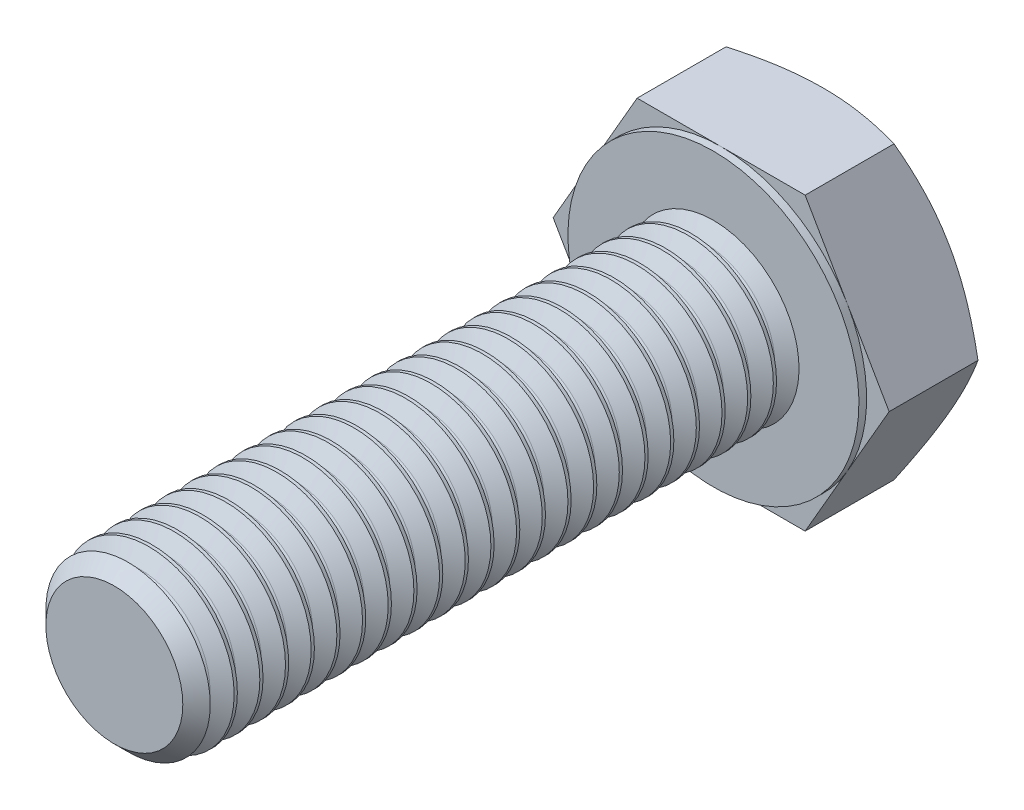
from build123d import *

# Parameters (mm, degrees)
SKETCH5_W               = 35
SKETCH5_H               = 5
THREAD_SIMPLE_COUNT     = 23
THREAD_SIMPLE_PITCH     = 1.5
SKETCH15_W              = 6.4
SKETCH15_H              = 10
SKETCH19_W              = 0.45
SKETCH19_H              = 1.5
SKETCH21_OUTSIDE_W      = 32.028
SKETCH21_OUTSIDE_H      = 32.028
CUT_PROFILE_OUTER_DEPTH = 38.749172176


with BuildPart() as part:
    # Sketch5 → body (revolve)
    with BuildSketch(Plane(origin=(0, 0, 0), x_dir=(0, 0, -1), z_dir=(1, 0, 0)), mode=Mode.PRIVATE) as body_sk:
        with Locations((-17.5, 2.5)):
            Rectangle(SKETCH5_W, SKETCH5_H)
    revolve(body_sk.sketch.rotate(Axis((0, 0, 35), (0, 0, -1)), 180), axis=Axis((0, 0, 35), (0, 0, -1)))

    # Sketch11 → cut-chamfer-start (revolve, cut)
    with BuildSketch(Plane(origin=(0, 0, 0), x_dir=(0, 0, -1), z_dir=(1, 0, 0))):
        Polygon((-35, -5), (-35, -4), (-34, -5), align=None)
    revolve(axis=Axis((0, 0, 35), (0, 0, -1)), mode=Mode.SUBTRACT)

    # Sketch8 → thread-single (revolve, cut)
    with BuildSketch(Plane(origin=(0, 0, 0), x_dir=(0, 0, -1), z_dir=(1, 0, 0)), mode=Mode.PRIVATE) as thread_single_sk:
        with BuildLine():
            Line((-1.3125, -5), (0, -5))
            Line((0, -5), (-0.515625, -4.106911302))
            ThreePointArc((-0.515625, -4.106911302), (-0.65625, -4.025721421), (-0.796875, -4.106911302))
            Line((-0.796875, -4.106911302), (-1.3125, -5))
        make_face()
    thread_single = revolve(thread_single_sk.sketch.rotate(Axis((0, 0, 35), (0, 0, -1)), 270), axis=Axis((0, 0, 35), (0, 0, -1)), mode=Mode.SUBTRACT)

    # thread-simple: thread-single ×23
    with Locations(*[(0, 0, i * THREAD_SIMPLE_PITCH) for i in range(1, THREAD_SIMPLE_COUNT)]):
        add(thread_single, mode=Mode.SUBTRACT)

    # Sketch15 → body-head (revolve)
    with BuildSketch(Plane(origin=(0, 0, 0), x_dir=(0, 0, -1), z_dir=(1, 0, 0)), mode=Mode.PRIVATE) as body_head_sk:
        with Locations((3.2, -5)):
            Rectangle(SKETCH15_W, SKETCH15_H)
    revolve(body_head_sk.sketch.rotate(Axis((0, 0, -6.4), (0, 0, 1)), 90), axis=Axis((0, 0, -6.4), (0, 0, 1)))

    # Sketch19 → cut-head-profile (revolve, cut)
    with BuildSketch(Plane(origin=(0, 0, 0), x_dir=(0, 0, -1), z_dir=(1, 0, 0)), mode=Mode.PRIVATE) as cut_head_profile_sk:
        with Locations((0.225, -9.25)):
            Rectangle(SKETCH19_W, SKETCH19_H)
        Polygon((6.4, -10), (6.4, -8.5), (5.533974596, -10), align=None)
    revolve(cut_head_profile_sk.sketch.rotate(Axis((0, 0, -6.4), (0, 0, 1)), 90), axis=Axis((0, 0, -6.4), (0, 0, 1)), mode=Mode.SUBTRACT)

    # Sketch21 outside → cut-profile-outer (cut, through all)
    with BuildSketch(Plane.XY):
        Rectangle(SKETCH21_OUTSIDE_W, SKETCH21_OUTSIDE_H)
        Polygon((9.814954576, 0), (4.907477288, 8.5), (-4.907477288, 8.5), (-9.814954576, 0), (-4.907477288, -8.5), (4.907477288, -8.5), align=None, mode=Mode.SUBTRACT)
    extrude(amount=-CUT_PROFILE_OUTER_DEPTH, mode=Mode.SUBTRACT)


solid = part.part
